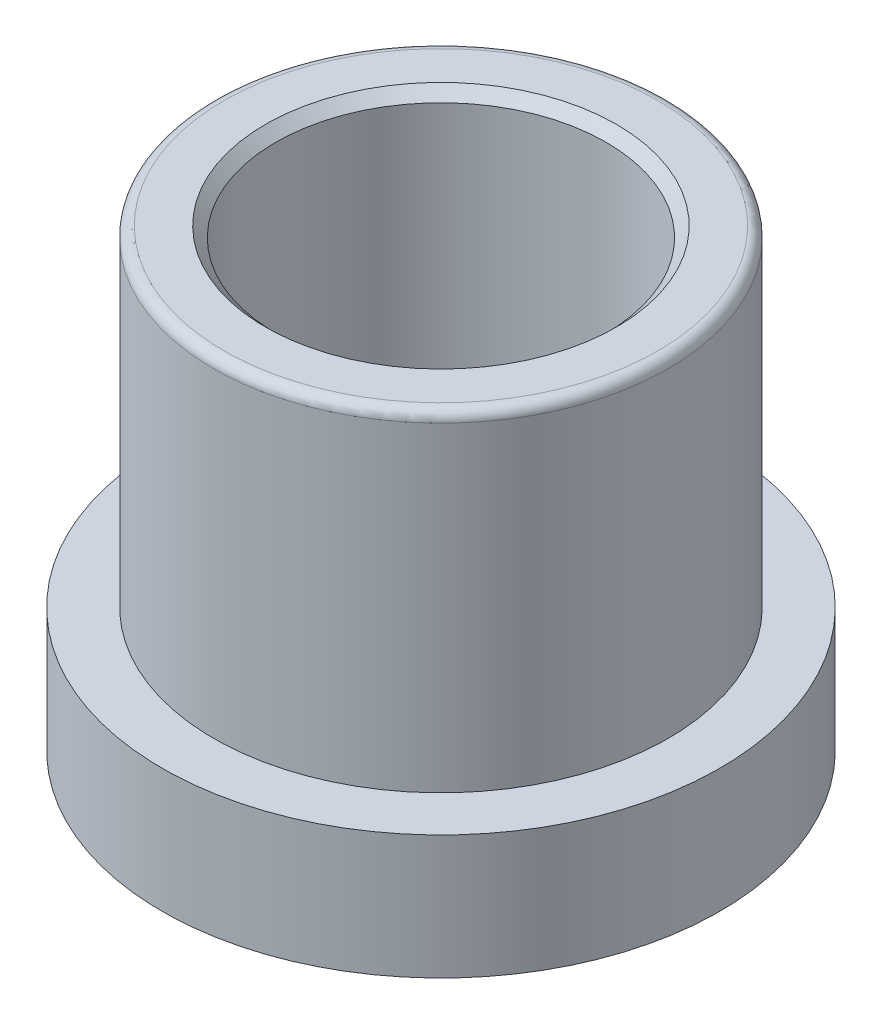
ISO-10303-21;
HEADER;
FILE_DESCRIPTION(('STEP AP214'),'2;1');
FILE_NAME('part.step','',(''),(''),'','','');
FILE_SCHEMA(('AUTOMOTIVE_DESIGN { 1 0 10303 214 1 1 1 1 }'));
ENDSEC;
DATA;
#1=APPLICATION_CONTEXT('core data for automotive mechanical design processes');
#2=APPLICATION_PROTOCOL_DEFINITION('international standard','automotive_design',2000,#1);
#3=PRODUCT_CONTEXT('',#1,'mechanical');
#4=PRODUCT('Part','Part','',(#3));
#5=PRODUCT_RELATED_PRODUCT_CATEGORY('part','',(#4));
#6=PRODUCT_DEFINITION_FORMATION('','',#4);
#7=PRODUCT_DEFINITION_CONTEXT('part definition',#1,'design');
#8=PRODUCT_DEFINITION('design','',#6,#7);
#9=PRODUCT_DEFINITION_SHAPE('','',#8);
#10=(LENGTH_UNIT() NAMED_UNIT(*) SI_UNIT(.MILLI.,.METRE.));
#11=(NAMED_UNIT(*) PLANE_ANGLE_UNIT() SI_UNIT($,.RADIAN.));
#12=(NAMED_UNIT(*) SI_UNIT($,.STERADIAN.) SOLID_ANGLE_UNIT());
#13=UNCERTAINTY_MEASURE_WITH_UNIT(LENGTH_MEASURE(1.E-05),#10,'distance_accuracy_value','');
#14=(GEOMETRIC_REPRESENTATION_CONTEXT(3) GLOBAL_UNCERTAINTY_ASSIGNED_CONTEXT((#13)) GLOBAL_UNIT_ASSIGNED_CONTEXT((#10,
#11,#12)) REPRESENTATION_CONTEXT('',''));
#15=CARTESIAN_POINT('',(0.,0.,0.));
#16=DIRECTION('',(0.,0.,1.));
#17=DIRECTION('',(1.,0.,0.));
#18=AXIS2_PLACEMENT_3D('',#15,#16,#17);
#19=CARTESIAN_POINT('',(0.,0.,0.));
#20=DIRECTION('',(0.,-1.,0.));
#21=DIRECTION('',(0.,0.,-1.));
#22=AXIS2_PLACEMENT_3D('',#19,#20,#21);
#23=CYLINDRICAL_SURFACE('',#22,11.);
#24=CARTESIAN_POINT('',(0.,15.5,0.));
#25=DIRECTION('',(0.,-1.,0.));
#26=DIRECTION('',(0.,0.,-1.));
#27=AXIS2_PLACEMENT_3D('',#24,#25,#26);
#28=CIRCLE('',#27,11.);
#29=CARTESIAN_POINT('',(0.,15.5,-11.));
#30=VERTEX_POINT('',#29);
#31=EDGE_CURVE('E21',#30,#30,#28,.T.);
#32=ORIENTED_EDGE('',*,*,#31,.T.);
#33=EDGE_LOOP('',(#32));
#34=FACE_BOUND('',#33,.T.);
#35=CARTESIAN_POINT('',(0.,0.,0.));
#36=DIRECTION('',(0.,-1.,0.));
#37=DIRECTION('',(0.,0.,-1.));
#38=AXIS2_PLACEMENT_3D('',#35,#36,#37);
#39=CIRCLE('',#38,11.);
#40=CARTESIAN_POINT('',(0.,0.,-11.));
#41=VERTEX_POINT('',#40);
#42=EDGE_CURVE('E49',#41,#41,#39,.T.);
#43=ORIENTED_EDGE('',*,*,#42,.F.);
#44=EDGE_LOOP('',(#43));
#45=FACE_BOUND('',#44,.T.);
#46=ADVANCED_FACE('F14',(#34,#45),#23,.T.);
#47=CARTESIAN_POINT('',(-11.,16.,0.));
#48=DIRECTION('',(0.,-1.,0.));
#49=DIRECTION('',(0.,0.,-1.));
#50=AXIS2_PLACEMENT_3D('',#47,#48,#49);
#51=PLANE('',#50);
#52=CARTESIAN_POINT('',(0.,16.,0.));
#53=DIRECTION('',(0.,-1.,0.));
#54=DIRECTION('',(0.,0.,-1.));
#55=AXIS2_PLACEMENT_3D('',#52,#53,#54);
#56=CIRCLE('',#55,10.5);
#57=CARTESIAN_POINT('',(0.,16.,-10.5));
#58=VERTEX_POINT('',#57);
#59=EDGE_CURVE('E9',#58,#58,#56,.F.);
#60=ORIENTED_EDGE('',*,*,#59,.T.);
#61=EDGE_LOOP('',(#60));
#62=FACE_BOUND('',#61,.T.);
#63=CARTESIAN_POINT('',(0.,16.,0.));
#64=DIRECTION('',(0.,-1.,0.));
#65=DIRECTION('',(0.,0.,-1.));
#66=AXIS2_PLACEMENT_3D('',#63,#64,#65);
#67=CIRCLE('',#66,8.5);
#68=CARTESIAN_POINT('',(0.,16.,-8.5));
#69=VERTEX_POINT('',#68);
#70=EDGE_CURVE('E37',#69,#69,#67,.T.);
#71=ORIENTED_EDGE('',*,*,#70,.T.);
#72=EDGE_LOOP('',(#71));
#73=FACE_BOUND('',#72,.T.);
#74=ADVANCED_FACE('F56',(#62,#73),#51,.F.);
#75=CARTESIAN_POINT('',(0.,0.,0.));
#76=DIRECTION('',(0.,-1.,0.));
#77=DIRECTION('',(0.,0.,-1.));
#78=AXIS2_PLACEMENT_3D('',#75,#76,#77);
#79=CYLINDRICAL_SURFACE('',#78,8.);
#80=CARTESIAN_POINT('',(0.,15.5,0.));
#81=DIRECTION('',(0.,-1.,0.));
#82=DIRECTION('',(0.,0.,-1.));
#83=AXIS2_PLACEMENT_3D('',#80,#81,#82);
#84=CIRCLE('',#83,8.);
#85=CARTESIAN_POINT('',(0.,15.5,-8.));
#86=VERTEX_POINT('',#85);
#87=EDGE_CURVE('E34',#86,#86,#84,.F.);
#88=ORIENTED_EDGE('',*,*,#87,.T.);
#89=EDGE_LOOP('',(#88));
#90=FACE_BOUND('',#89,.T.);
#91=CARTESIAN_POINT('',(0.,-6.,0.));
#92=DIRECTION('',(0.,-1.,0.));
#93=DIRECTION('',(0.,0.,-1.));
#94=AXIS2_PLACEMENT_3D('',#91,#92,#93);
#95=CIRCLE('',#94,8.);
#96=CARTESIAN_POINT('',(0.,-6.,-8.));
#97=VERTEX_POINT('',#96);
#98=EDGE_CURVE('E40',#97,#97,#95,.T.);
#99=ORIENTED_EDGE('',*,*,#98,.T.);
#100=EDGE_LOOP('',(#99));
#101=FACE_BOUND('',#100,.T.);
#102=ADVANCED_FACE('F63',(#90,#101),#79,.F.);
#103=CARTESIAN_POINT('',(0.,-6.15,0.));
#104=DIRECTION('',(0.,-1.,0.));
#105=DIRECTION('',(0.,0.,-1.));
#106=AXIS2_PLACEMENT_3D('',#103,#104,#105);
#107=CONICAL_SURFACE('',#106,8.1,0.588002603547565);
#108=CARTESIAN_POINT('',(0.,-6.36,0.));
#109=DIRECTION('',(0.,1.,0.));
#110=DIRECTION('',(0.,0.,1.));
#111=AXIS2_PLACEMENT_3D('',#108,#109,#110);
#112=CIRCLE('',#111,8.24);
#113=CARTESIAN_POINT('',(0.,-6.36,8.24));
#114=VERTEX_POINT('',#113);
#115=EDGE_CURVE('E25',#114,#114,#112,.F.);
#116=ORIENTED_EDGE('',*,*,#115,.T.);
#117=EDGE_LOOP('',(#116));
#118=FACE_BOUND('',#117,.T.);
#119=ORIENTED_EDGE('',*,*,#98,.F.);
#120=EDGE_LOOP('',(#119));
#121=FACE_BOUND('',#120,.T.);
#122=ADVANCED_FACE('F82',(#118,#121),#107,.F.);
#123=CARTESIAN_POINT('',(-8.1,-6.,0.));
#124=DIRECTION('',(0.,1.,0.));
#125=DIRECTION('',(0.,0.,1.));
#126=AXIS2_PLACEMENT_3D('',#123,#124,#125);
#127=PLANE('',#126);
#128=CARTESIAN_POINT('',(0.,-6.,0.));
#129=DIRECTION('',(0.,1.,0.));
#130=DIRECTION('',(0.,0.,1.));
#131=AXIS2_PLACEMENT_3D('',#128,#129,#130);
#132=CIRCLE('',#131,8.6);
#133=CARTESIAN_POINT('',(0.,-6.,8.6));
#134=VERTEX_POINT('',#133);
#135=EDGE_CURVE('E29',#134,#134,#132,.T.);
#136=ORIENTED_EDGE('',*,*,#135,.T.);
#137=EDGE_LOOP('',(#136));
#138=FACE_BOUND('',#137,.T.);
#139=CARTESIAN_POINT('',(0.,-6.,0.));
#140=DIRECTION('',(0.,-1.,0.));
#141=DIRECTION('',(0.,0.,-1.));
#142=AXIS2_PLACEMENT_3D('',#139,#140,#141);
#143=CIRCLE('',#142,13.5);
#144=CARTESIAN_POINT('',(0.,-6.,-13.5));
#145=VERTEX_POINT('',#144);
#146=EDGE_CURVE('E43',#145,#145,#143,.T.);
#147=ORIENTED_EDGE('',*,*,#146,.T.);
#148=EDGE_LOOP('',(#147));
#149=FACE_BOUND('',#148,.T.);
#150=ADVANCED_FACE('F85',(#138,#149),#127,.F.);
#151=CARTESIAN_POINT('',(0.,0.,0.));
#152=DIRECTION('',(0.,-1.,0.));
#153=DIRECTION('',(0.,0.,-1.));
#154=AXIS2_PLACEMENT_3D('',#151,#152,#153);
#155=CYLINDRICAL_SURFACE('',#154,13.5);
#156=ORIENTED_EDGE('',*,*,#146,.F.);
#157=EDGE_LOOP('',(#156));
#158=FACE_BOUND('',#157,.T.);
#159=CARTESIAN_POINT('',(0.,0.,0.));
#160=DIRECTION('',(0.,-1.,0.));
#161=DIRECTION('',(0.,0.,-1.));
#162=AXIS2_PLACEMENT_3D('',#159,#160,#161);
#163=CIRCLE('',#162,13.5);
#164=CARTESIAN_POINT('',(0.,0.,-13.5));
#165=VERTEX_POINT('',#164);
#166=EDGE_CURVE('E46',#165,#165,#163,.T.);
#167=ORIENTED_EDGE('',*,*,#166,.T.);
#168=EDGE_LOOP('',(#167));
#169=FACE_BOUND('',#168,.T.);
#170=ADVANCED_FACE('F97',(#158,#169),#155,.T.);
#171=CARTESIAN_POINT('',(-13.5,0.,0.));
#172=DIRECTION('',(0.,-1.,0.));
#173=DIRECTION('',(0.,0.,-1.));
#174=AXIS2_PLACEMENT_3D('',#171,#172,#173);
#175=PLANE('',#174);
#176=ORIENTED_EDGE('',*,*,#166,.F.);
#177=EDGE_LOOP('',(#176));
#178=FACE_BOUND('',#177,.T.);
#179=ORIENTED_EDGE('',*,*,#42,.T.);
#180=EDGE_LOOP('',(#179));
#181=FACE_BOUND('',#180,.T.);
#182=ADVANCED_FACE('F53',(#178,#181),#175,.F.);
#183=CARTESIAN_POINT('',(0.,16.,0.));
#184=DIRECTION('',(0.,1.,0.));
#185=DIRECTION('',(0.,0.,1.));
#186=AXIS2_PLACEMENT_3D('',#183,#184,#185);
#187=CONICAL_SURFACE('',#186,8.5,0.785398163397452);
#188=ORIENTED_EDGE('',*,*,#87,.F.);
#189=EDGE_LOOP('',(#188));
#190=FACE_BOUND('',#189,.T.);
#191=ORIENTED_EDGE('',*,*,#70,.F.);
#192=EDGE_LOOP('',(#191));
#193=FACE_BOUND('',#192,.T.);
#194=ADVANCED_FACE('F67',(#190,#193),#187,.F.);
#195=CARTESIAN_POINT('',(0.,-6.5,0.));
#196=DIRECTION('',(0.,1.,0.));
#197=DIRECTION('',(0.,0.,1.));
#198=AXIS2_PLACEMENT_3D('',#195,#196,#197);
#199=CONICAL_SURFACE('',#198,8.1,0.785398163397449);
#200=ORIENTED_EDGE('',*,*,#135,.F.);
#201=EDGE_LOOP('',(#200));
#202=FACE_BOUND('',#201,.T.);
#203=ORIENTED_EDGE('',*,*,#115,.F.);
#204=EDGE_LOOP('',(#203));
#205=FACE_BOUND('',#204,.T.);
#206=ADVANCED_FACE('F69',(#202,#205),#199,.T.);
#207=CARTESIAN_POINT('',(0.,15.5,0.));
#208=DIRECTION('',(0.,-1.,0.));
#209=DIRECTION('',(0.,0.,-1.));
#210=AXIS2_PLACEMENT_3D('',#207,#208,#209);
#211=TOROIDAL_SURFACE('',#210,10.5,0.5);
#212=ORIENTED_EDGE('',*,*,#59,.F.);
#213=EDGE_LOOP('',(#212));
#214=FACE_BOUND('',#213,.T.);
#215=ORIENTED_EDGE('',*,*,#31,.F.);
#216=EDGE_LOOP('',(#215));
#217=FACE_BOUND('',#216,.T.);
#218=ADVANCED_FACE('F16',(#214,#217),#211,.T.);
#219=CLOSED_SHELL('',(#46,#74,#102,#122,#150,#170,#182,#194,#206,#218));
#220=MANIFOLD_SOLID_BREP('B1',#219);
#221=ADVANCED_BREP_SHAPE_REPRESENTATION('',(#18,#220),#14);
#222=SHAPE_DEFINITION_REPRESENTATION(#9,#221);
ENDSEC;
END-ISO-10303-21;
